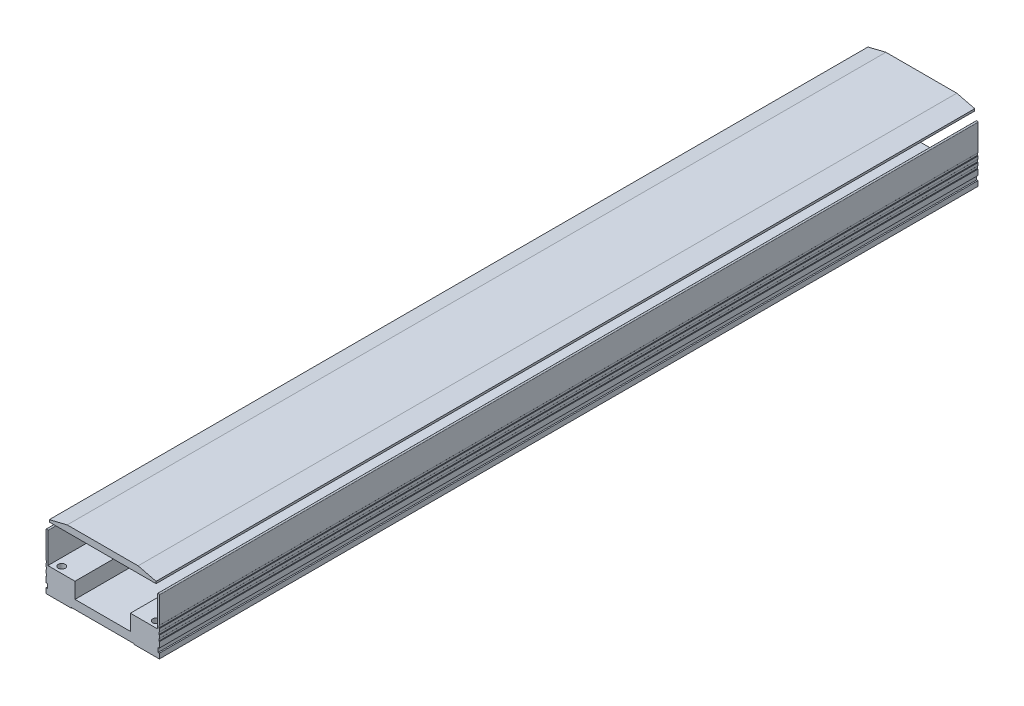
from build123d import *

# Parameters (mm, degrees)
EXTRUDE_1_DEPTH             = 1300
EXTRUDE_1_2_DEPTH           = 1300
HOLE_WIZARD_1_AT_2_COUNT    = 2
HOLE_WIZARD_1_AT_2_PITCH    = 150
HOLE_WIZARD_M8_1_AT_2_COUNT = 2
HOLE_WIZARD_M8_1_AT_2_PITCH = 130
PATTERN_LINEAR_1_COUNT      = 13
PATTERN_LINEAR_1_PITCH      = 100


with BuildPart() as part:
    # Sketch 1 → Extrude 1 (new body)
    with BuildSketch(Plane.XY):
        Polygon((84.8, 100), (84.8, 103.28), (56.28125, 110.3), (-56.28125, 110.3), (-84.8, 103.28), (-84.8, 100), align=None)
    extrude(amount=EXTRUDE_1_DEPTH)


with BuildPart() as body_2:
    # Sketch 1 → Extrude 1 2 (new body)
    with BuildSketch(Plane.XY):
        with BuildLine():
            Line((50, -1), (90, -1))
            Line((90, -1), (90, 7))
            Line((90, 7), (88, 7))
            Line((88, 7), (88, 14))
            Line((88, 14), (90, 14))
            Line((90, 14), (90, 22.7))
            ThreePointArc((90, 22.7), (89.912132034, 22.912132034), (89.7, 23))
            Line((89.7, 23), (89.5, 23))
            ThreePointArc((89.5, 23), (89.287867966, 23.087867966), (89.2, 23.3))
            Line((89.2, 23.3), (89.2, 26.7))
            ThreePointArc((89.2, 26.7), (89.287867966, 26.912132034), (89.5, 27))
            Line((89.5, 27), (89.7, 27))
            ThreePointArc((89.7, 27), (89.912132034, 27.087867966), (90, 27.3))
            Line((90, 27.3), (90, 31.7))
            ThreePointArc((90, 31.7), (89.912132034, 31.912132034), (89.7, 32))
            Line((89.7, 32), (89.5, 32))
            ThreePointArc((89.5, 32), (89.287867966, 32.087867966), (89.2, 32.3))
            Line((89.2, 32.3), (89.2, 35.7))
            ThreePointArc((89.2, 35.7), (89.287867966, 35.912132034), (89.5, 36))
            Line((89.5, 36), (89.7, 36))
            ThreePointArc((89.7, 36), (89.912132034, 36.087867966), (90, 36.3))
            Line((90, 36.3), (90, 40.7))
            ThreePointArc((90, 40.7), (89.912132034, 40.912132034), (89.7, 41))
            Line((89.7, 41), (89.5, 41))
            ThreePointArc((89.5, 41), (89.287867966, 41.087867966), (89.2, 41.3))
            Line((89.2, 41.3), (89.2, 44.7))
            ThreePointArc((89.2, 44.7), (89.287867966, 44.912132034), (89.5, 45))
            Line((89.5, 45), (89.7, 45))
            ThreePointArc((89.7, 45), (89.912132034, 45.087867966), (90, 45.3))
            Line((90, 45.3), (90, 87))
            ThreePointArc((90, 87), (88.5, 88.5), (87, 87))
            Line((87, 87), (87, 39))
            Line((87, 39), (44, 39))
            Line((44, 39), (44, 14))
            Line((44, 14), (-44, 14))
            Line((-44, 14), (-44, 39))
            Line((-44, 39), (-87, 39))
            Line((-87, 39), (-87, 87))
            ThreePointArc((-87, 87), (-88.5, 88.5), (-90, 87))
            Line((-90, 87), (-90, 45.3))
            ThreePointArc((-90, 45.3), (-89.912132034, 45.087867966), (-89.7, 45))
            Line((-89.7, 45), (-89.5, 45))
            ThreePointArc((-89.5, 45), (-89.287867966, 44.912132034), (-89.2, 44.7))
            Line((-89.2, 44.7), (-89.2, 41.3))
            ThreePointArc((-89.2, 41.3), (-89.287867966, 41.087867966), (-89.5, 41))
            Line((-89.5, 41), (-89.7, 41))
            ThreePointArc((-89.7, 41), (-89.912132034, 40.912132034), (-90, 40.7))
            Line((-90, 40.7), (-90, 36.3))
            ThreePointArc((-90, 36.3), (-89.912132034, 36.087867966), (-89.7, 36))
            Line((-89.7, 36), (-89.5, 36))
            ThreePointArc((-89.5, 36), (-89.287867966, 35.912132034), (-89.2, 35.7))
            Line((-89.2, 35.7), (-89.2, 32.3))
            ThreePointArc((-89.2, 32.3), (-89.287867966, 32.087867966), (-89.5, 32))
            Line((-89.5, 32), (-89.7, 32))
            ThreePointArc((-89.7, 32), (-89.912132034, 31.912132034), (-90, 31.7))
            Line((-90, 31.7), (-90, 27.3))
            ThreePointArc((-90, 27.3), (-89.912132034, 27.087867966), (-89.7, 27))
            Line((-89.7, 27), (-89.5, 27))
            ThreePointArc((-89.5, 27), (-89.287867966, 26.912132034), (-89.2, 26.7))
            Line((-89.2, 26.7), (-89.2, 23.3))
            ThreePointArc((-89.2, 23.3), (-89.287867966, 23.087867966), (-89.5, 23))
            Line((-89.5, 23), (-89.7, 23))
            ThreePointArc((-89.7, 23), (-89.912132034, 22.912132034), (-90, 22.7))
            Line((-90, 22.7), (-90, 14))
            Line((-90, 14), (-88, 14))
            Line((-88, 14), (-88, 7))
            Line((-88, 7), (-90, 7))
            Line((-90, 7), (-90, -1))
            Line((-90, -1), (-50, -1))
            Line((-50, -1), (-50, 0))
            Line((-50, 0), (50, 0))
            Line((50, 0), (50, -1))
        make_face()
    extrude(amount=EXTRUDE_1_2_DEPTH)

    # Sketch 3 → Hole Wizard 1 (revolve, cut)
    with BuildSketch(Plane(origin=(-75, 39, 90), x_dir=(0, 0, 1), z_dir=(1, 0, 0))):
        Polygon((0, 0), (0, 40), (3.3, 40), (3.3, 37.5), (5.5, 37.5), (5.5, 0), align=None)
    hole_wizard_1 = revolve(axis=Axis((-75, 45.35, 90), (0, -1, 0)), mode=Mode.SUBTRACT)

    # Hole Wizard 1 at 2: Hole Wizard 1 ×2
    with Locations(*[(i * HOLE_WIZARD_1_AT_2_PITCH, 0, 0) for i in range(1, HOLE_WIZARD_1_AT_2_COUNT)]):
        add(hole_wizard_1, mode=Mode.SUBTRACT)

    # Sketch 5 → Hole Wizard M8 _1 (revolve, cut)
    with BuildSketch(Plane(origin=(65, -1, 40), x_dir=(0, 0, -1), z_dir=(1, 0, 0))):
        Polygon((0, 0), (0, 21.792926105), (3.4, 19.75), (3.4, 0), align=None)
    hole_wizard_m8_1 = revolve(axis=Axis((65, -7.35, 40), (0, 1, 0)), mode=Mode.SUBTRACT)

    # Hole Wizard M8 _1 at 2: Hole Wizard M8 _1 ×2
    with Locations(*[(-i * HOLE_WIZARD_M8_1_AT_2_PITCH, 0, 0) for i in range(1, HOLE_WIZARD_M8_1_AT_2_COUNT)]):
        add(hole_wizard_m8_1, mode=Mode.SUBTRACT)

    # Pattern Linear 1: Hole Wizard 1, Hole Wizard M8 _1 ×13
    with Locations(*[(0, 0, i * PATTERN_LINEAR_1_PITCH) for i in range(1, PATTERN_LINEAR_1_COUNT)]):
        add(hole_wizard_1, mode=Mode.SUBTRACT)
        add(hole_wizard_m8_1, mode=Mode.SUBTRACT)

    # Pattern Linear 1 copy 1 sketch → Pattern Linear 1 copy 1 (revolve, cut)
    with BuildSketch(Plane(origin=(75, 39, 190), x_dir=(0, 0, 1), z_dir=(1, 0, 0))):
        Polygon((0, 0), (0, 40), (3.3, 40), (3.3, 37.5), (5.5, 37.5), (5.5, 0), align=None)
    revolve(axis=Axis((75, 45.35, 190), (0, -1, 0)), mode=Mode.SUBTRACT)

    # Pattern Linear 1 copy 2 sketch → Pattern Linear 1 copy 2 (revolve, cut)
    with BuildSketch(Plane(origin=(75, 39, 290), x_dir=(0, 0, 1), z_dir=(1, 0, 0))):
        Polygon((0, 0), (0, 40), (3.3, 40), (3.3, 37.5), (5.5, 37.5), (5.5, 0), align=None)
    revolve(axis=Axis((75, 45.35, 290), (0, -1, 0)), mode=Mode.SUBTRACT)

    # Pattern Linear 1 copy 3 sketch → Pattern Linear 1 copy 3 (revolve, cut)
    with BuildSketch(Plane(origin=(75, 39, 390), x_dir=(0, 0, 1), z_dir=(1, 0, 0))):
        Polygon((0, 0), (0, 40), (3.3, 40), (3.3, 37.5), (5.5, 37.5), (5.5, 0), align=None)
    revolve(axis=Axis((75, 45.35, 390), (0, -1, 0)), mode=Mode.SUBTRACT)

    # Pattern Linear 1 copy 4 sketch → Pattern Linear 1 copy 4 (revolve, cut)
    with BuildSketch(Plane(origin=(75, 39, 490), x_dir=(0, 0, 1), z_dir=(1, 0, 0))):
        Polygon((0, 0), (0, 40), (3.3, 40), (3.3, 37.5), (5.5, 37.5), (5.5, 0), align=None)
    revolve(axis=Axis((75, 45.35, 490), (0, -1, 0)), mode=Mode.SUBTRACT)

    # Pattern Linear 1 copy 5 sketch → Pattern Linear 1 copy 5 (revolve, cut)
    with BuildSketch(Plane(origin=(75, 39, 590), x_dir=(0, 0, 1), z_dir=(1, 0, 0))):
        Polygon((0, 0), (0, 40), (3.3, 40), (3.3, 37.5), (5.5, 37.5), (5.5, 0), align=None)
    revolve(axis=Axis((75, 45.35, 590), (0, -1, 0)), mode=Mode.SUBTRACT)

    # Pattern Linear 1 copy 6 sketch → Pattern Linear 1 copy 6 (revolve, cut)
    with BuildSketch(Plane(origin=(75, 39, 690), x_dir=(0, 0, 1), z_dir=(1, 0, 0))):
        Polygon((0, 0), (0, 40), (3.3, 40), (3.3, 37.5), (5.5, 37.5), (5.5, 0), align=None)
    revolve(axis=Axis((75, 45.35, 690), (0, -1, 0)), mode=Mode.SUBTRACT)

    # Pattern Linear 1 copy 7 sketch → Pattern Linear 1 copy 7 (revolve, cut)
    with BuildSketch(Plane(origin=(75, 39, 790), x_dir=(0, 0, 1), z_dir=(1, 0, 0))):
        Polygon((0, 0), (0, 40), (3.3, 40), (3.3, 37.5), (5.5, 37.5), (5.5, 0), align=None)
    revolve(axis=Axis((75, 45.35, 790), (0, -1, 0)), mode=Mode.SUBTRACT)

    # Pattern Linear 1 copy 8 sketch → Pattern Linear 1 copy 8 (revolve, cut)
    with BuildSketch(Plane(origin=(75, 39, 890), x_dir=(0, 0, 1), z_dir=(1, 0, 0))):
        Polygon((0, 0), (0, 40), (3.3, 40), (3.3, 37.5), (5.5, 37.5), (5.5, 0), align=None)
    revolve(axis=Axis((75, 45.35, 890), (0, -1, 0)), mode=Mode.SUBTRACT)

    # Pattern Linear 1 copy 9 sketch → Pattern Linear 1 copy 9 (revolve, cut)
    with BuildSketch(Plane(origin=(75, 39, 990), x_dir=(0, 0, 1), z_dir=(1, 0, 0))):
        Polygon((0, 0), (0, 40), (3.3, 40), (3.3, 37.5), (5.5, 37.5), (5.5, 0), align=None)
    revolve(axis=Axis((75, 45.35, 990), (0, -1, 0)), mode=Mode.SUBTRACT)

    # Pattern Linear 1 copy 10 sketch → Pattern Linear 1 copy 10 (revolve, cut)
    with BuildSketch(Plane(origin=(75, 39, 1090), x_dir=(0, 0, 1), z_dir=(1, 0, 0))):
        Polygon((0, 0), (0, 40), (3.3, 40), (3.3, 37.5), (5.5, 37.5), (5.5, 0), align=None)
    revolve(axis=Axis((75, 45.35, 1090), (0, -1, 0)), mode=Mode.SUBTRACT)

    # Pattern Linear 1 copy 11 sketch → Pattern Linear 1 copy 11 (revolve, cut)
    with BuildSketch(Plane(origin=(75, 39, 1190), x_dir=(0, 0, 1), z_dir=(1, 0, 0))):
        Polygon((0, 0), (0, 40), (3.3, 40), (3.3, 37.5), (5.5, 37.5), (5.5, 0), align=None)
    revolve(axis=Axis((75, 45.35, 1190), (0, -1, 0)), mode=Mode.SUBTRACT)

    # Pattern Linear 1 copy 12 sketch → Pattern Linear 1 copy 12 (revolve, cut)
    with BuildSketch(Plane(origin=(75, 39, 1290), x_dir=(0, 0, 1), z_dir=(1, 0, 0))):
        Polygon((0, 0), (0, 40), (3.3, 40), (3.3, 37.5), (5.5, 37.5), (5.5, 0), align=None)
    revolve(axis=Axis((75, 45.35, 1290), (0, -1, 0)), mode=Mode.SUBTRACT)

    # Pattern Linear 1 copy 13 sketch → Pattern Linear 1 copy 13 (revolve, cut)
    with BuildSketch(Plane(origin=(-65, -1, 140), x_dir=(0, 0, -1), z_dir=(1, 0, 0))):
        Polygon((0, 0), (0, 21.792926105), (3.4, 19.75), (3.4, 0), align=None)
    revolve(axis=Axis((-65, -7.35, 140), (0, 1, 0)), mode=Mode.SUBTRACT)

    # Pattern Linear 1 copy 14 sketch → Pattern Linear 1 copy 14 (revolve, cut)
    with BuildSketch(Plane(origin=(-65, -1, 240), x_dir=(0, 0, -1), z_dir=(1, 0, 0))):
        Polygon((0, 0), (0, 21.792926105), (3.4, 19.75), (3.4, 0), align=None)
    revolve(axis=Axis((-65, -7.35, 240), (0, 1, 0)), mode=Mode.SUBTRACT)

    # Pattern Linear 1 copy 15 sketch → Pattern Linear 1 copy 15 (revolve, cut)
    with BuildSketch(Plane(origin=(-65, -1, 340), x_dir=(0, 0, -1), z_dir=(1, 0, 0))):
        Polygon((0, 0), (0, 21.792926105), (3.4, 19.75), (3.4, 0), align=None)
    revolve(axis=Axis((-65, -7.35, 340), (0, 1, 0)), mode=Mode.SUBTRACT)

    # Pattern Linear 1 copy 16 sketch → Pattern Linear 1 copy 16 (revolve, cut)
    with BuildSketch(Plane(origin=(-65, -1, 440), x_dir=(0, 0, -1), z_dir=(1, 0, 0))):
        Polygon((0, 0), (0, 21.792926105), (3.4, 19.75), (3.4, 0), align=None)
    revolve(axis=Axis((-65, -7.35, 440), (0, 1, 0)), mode=Mode.SUBTRACT)

    # Pattern Linear 1 copy 17 sketch → Pattern Linear 1 copy 17 (revolve, cut)
    with BuildSketch(Plane(origin=(-65, -1, 540), x_dir=(0, 0, -1), z_dir=(1, 0, 0))):
        Polygon((0, 0), (0, 21.792926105), (3.4, 19.75), (3.4, 0), align=None)
    revolve(axis=Axis((-65, -7.35, 540), (0, 1, 0)), mode=Mode.SUBTRACT)

    # Pattern Linear 1 copy 18 sketch → Pattern Linear 1 copy 18 (revolve, cut)
    with BuildSketch(Plane(origin=(-65, -1, 640), x_dir=(0, 0, -1), z_dir=(1, 0, 0))):
        Polygon((0, 0), (0, 21.792926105), (3.4, 19.75), (3.4, 0), align=None)
    revolve(axis=Axis((-65, -7.35, 640), (0, 1, 0)), mode=Mode.SUBTRACT)

    # Pattern Linear 1 copy 19 sketch → Pattern Linear 1 copy 19 (revolve, cut)
    with BuildSketch(Plane(origin=(-65, -1, 740), x_dir=(0, 0, -1), z_dir=(1, 0, 0))):
        Polygon((0, 0), (0, 21.792926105), (3.4, 19.75), (3.4, 0), align=None)
    revolve(axis=Axis((-65, -7.35, 740), (0, 1, 0)), mode=Mode.SUBTRACT)

    # Pattern Linear 1 copy 20 sketch → Pattern Linear 1 copy 20 (revolve, cut)
    with BuildSketch(Plane(origin=(-65, -1, 840), x_dir=(0, 0, -1), z_dir=(1, 0, 0))):
        Polygon((0, 0), (0, 21.792926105), (3.4, 19.75), (3.4, 0), align=None)
    revolve(axis=Axis((-65, -7.35, 840), (0, 1, 0)), mode=Mode.SUBTRACT)

    # Pattern Linear 1 copy 21 sketch → Pattern Linear 1 copy 21 (revolve, cut)
    with BuildSketch(Plane(origin=(-65, -1, 940), x_dir=(0, 0, -1), z_dir=(1, 0, 0))):
        Polygon((0, 0), (0, 21.792926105), (3.4, 19.75), (3.4, 0), align=None)
    revolve(axis=Axis((-65, -7.35, 940), (0, 1, 0)), mode=Mode.SUBTRACT)

    # Pattern Linear 1 copy 22 sketch → Pattern Linear 1 copy 22 (revolve, cut)
    with BuildSketch(Plane(origin=(-65, -1, 1040), x_dir=(0, 0, -1), z_dir=(1, 0, 0))):
        Polygon((0, 0), (0, 21.792926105), (3.4, 19.75), (3.4, 0), align=None)
    revolve(axis=Axis((-65, -7.35, 1040), (0, 1, 0)), mode=Mode.SUBTRACT)

    # Pattern Linear 1 copy 23 sketch → Pattern Linear 1 copy 23 (revolve, cut)
    with BuildSketch(Plane(origin=(-65, -1, 1140), x_dir=(0, 0, -1), z_dir=(1, 0, 0))):
        Polygon((0, 0), (0, 21.792926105), (3.4, 19.75), (3.4, 0), align=None)
    revolve(axis=Axis((-65, -7.35, 1140), (0, 1, 0)), mode=Mode.SUBTRACT)

    # Pattern Linear 1 copy 24 sketch → Pattern Linear 1 copy 24 (revolve, cut)
    with BuildSketch(Plane(origin=(-65, -1, 1240), x_dir=(0, 0, -1), z_dir=(1, 0, 0))):
        Polygon((0, 0), (0, 21.792926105), (3.4, 19.75), (3.4, 0), align=None)
    revolve(axis=Axis((-65, -7.35, 1240), (0, 1, 0)), mode=Mode.SUBTRACT)


solid = Compound([part.part, body_2.part])
